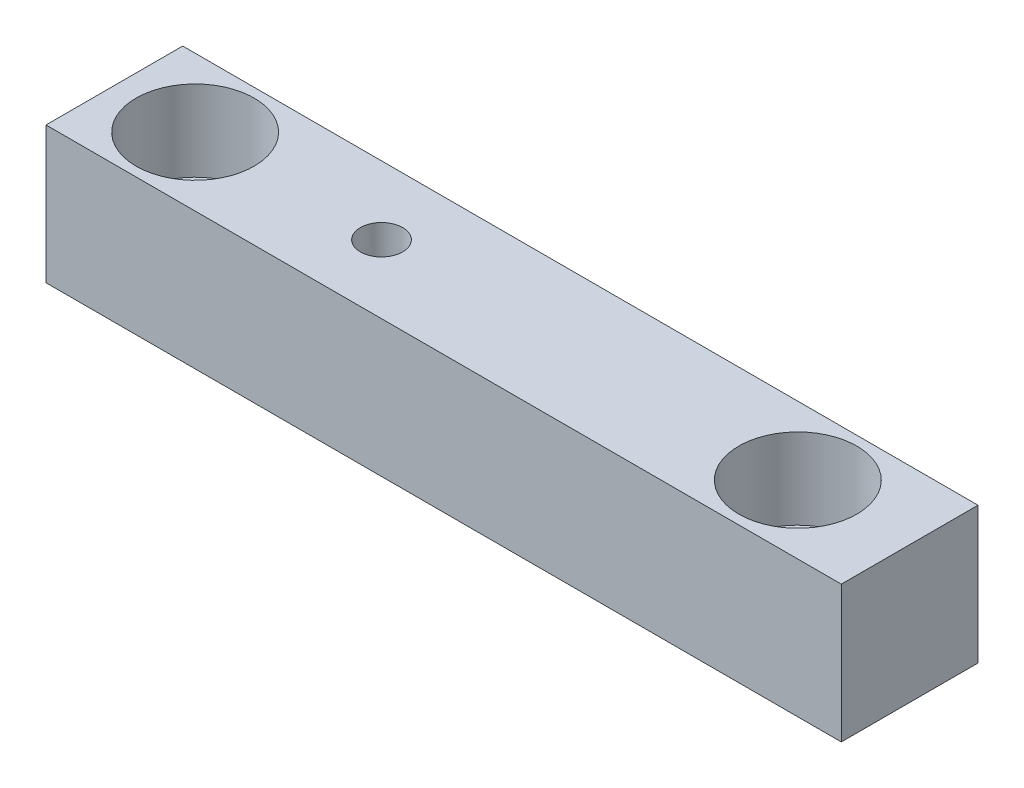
from build123d import *

# Parameters (mm, degrees)
ESQUISSE1_W             = 128
ESQUISSE1_H             = 22
BOSS_EXTRU_1_DEPTH      = 22
ESQUISSE6_R             = 6.25
ENL_V_MAT_EXTRU_1_DEPTH = 132.726990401
ESQUISSE8_R             = 9.5
ENL_V_MAT_EXTRU_2_DEPTH = 13
TROU_TARAUD_M81_D       = 6.8


with BuildPart() as part:
    # Esquisse1 → Boss.-Extru.1 (new body)
    with BuildSketch(Plane.XY):
        with Locations((64, 11)):
            Rectangle(ESQUISSE1_W, ESQUISSE1_H)
    extrude(amount=BOSS_EXTRU_1_DEPTH)

    # Esquisse6 → Enl_v. mat.-Extru.1 (cut, through all)
    with BuildSketch(Plane(origin=(0, 22, 0), x_dir=(1, 0, 0), z_dir=(0, 1, 0))):
        with Locations(Location((13, -11, 0), (0, 0, 270))):
            Circle(ESQUISSE6_R)
        with Locations(Location((110, -11, 0), (0, 0, 270))):
            Circle(ESQUISSE6_R)
    extrude(amount=-ENL_V_MAT_EXTRU_1_DEPTH, mode=Mode.SUBTRACT)

    # Esquisse8 → Enl_v. mat.-Extru.2 (cut)
    with BuildSketch(Plane(origin=(0, 22, 0), x_dir=(1, 0, 0), z_dir=(0, 1, 0))):
        with Locations(Location((13, -11, 0), (0, 0, 270))):
            Circle(ESQUISSE8_R)
        with Locations(Location((110, -11, 0), (0, 0, 270))):
            Circle(ESQUISSE8_R)
    extrude(amount=-ENL_V_MAT_EXTRU_2_DEPTH, mode=Mode.SUBTRACT)

    # Trou taraud_ M81 (through all)
    with Locations(Plane(origin=(0, 22, 0), x_dir=(1, 0, 0), z_dir=(0, 1, 0))):
        with Locations((43, -11)):
            Hole(TROU_TARAUD_M81_D / 2)


solid = part.part
